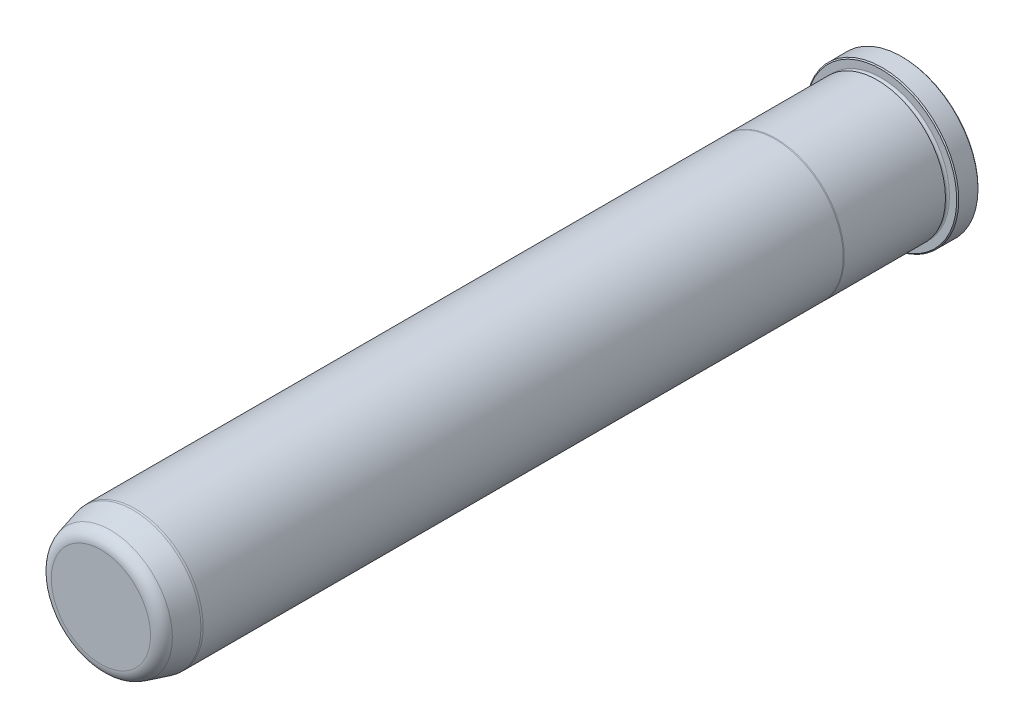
ISO-10303-21;
HEADER;
FILE_DESCRIPTION(('STEP AP214'),'2;1');
FILE_NAME('part.step','',(''),(''),'','','');
FILE_SCHEMA(('AUTOMOTIVE_DESIGN { 1 0 10303 214 1 1 1 1 }'));
ENDSEC;
DATA;
#1=APPLICATION_CONTEXT('core data for automotive mechanical design processes');
#2=APPLICATION_PROTOCOL_DEFINITION('international standard','automotive_design',2000,#1);
#3=PRODUCT_CONTEXT('',#1,'mechanical');
#4=PRODUCT('Part','Part','',(#3));
#5=PRODUCT_RELATED_PRODUCT_CATEGORY('part','',(#4));
#6=PRODUCT_DEFINITION_FORMATION('','',#4);
#7=PRODUCT_DEFINITION_CONTEXT('part definition',#1,'design');
#8=PRODUCT_DEFINITION('design','',#6,#7);
#9=PRODUCT_DEFINITION_SHAPE('','',#8);
#10=(LENGTH_UNIT() NAMED_UNIT(*) SI_UNIT(.MILLI.,.METRE.));
#11=(NAMED_UNIT(*) PLANE_ANGLE_UNIT() SI_UNIT($,.RADIAN.));
#12=(NAMED_UNIT(*) SI_UNIT($,.STERADIAN.) SOLID_ANGLE_UNIT());
#13=UNCERTAINTY_MEASURE_WITH_UNIT(LENGTH_MEASURE(1.E-05),#10,'distance_accuracy_value','');
#14=(GEOMETRIC_REPRESENTATION_CONTEXT(3) GLOBAL_UNCERTAINTY_ASSIGNED_CONTEXT((#13)) GLOBAL_UNIT_ASSIGNED_CONTEXT((#10,
#11,#12)) REPRESENTATION_CONTEXT('',''));
#15=CARTESIAN_POINT('',(0.,0.,0.));
#16=DIRECTION('',(0.,0.,1.));
#17=DIRECTION('',(1.,0.,0.));
#18=AXIS2_PLACEMENT_3D('',#15,#16,#17);
#19=CARTESIAN_POINT('',(0.,0.,0.));
#20=DIRECTION('',(0.,0.,1.));
#21=DIRECTION('',(1.,0.,0.));
#22=AXIS2_PLACEMENT_3D('',#19,#20,#21);
#23=PLANE('',#22);
#24=CARTESIAN_POINT('',(0.,0.,0.));
#25=DIRECTION('',(0.,0.,1.));
#26=DIRECTION('',(1.,0.,0.));
#27=AXIS2_PLACEMENT_3D('',#24,#25,#26);
#28=CIRCLE('',#27,28.067);
#29=CARTESIAN_POINT('',(28.067,0.,0.));
#30=VERTEX_POINT('',#29);
#31=EDGE_CURVE('E37',#30,#30,#28,.F.);
#32=ORIENTED_EDGE('',*,*,#31,.T.);
#33=EDGE_LOOP('',(#32));
#34=FACE_BOUND('',#33,.T.);
#35=ADVANCED_FACE('F30',(#34),#23,.F.);
#36=CARTESIAN_POINT('',(0.,0.,0.));
#37=DIRECTION('',(0.,0.,1.));
#38=DIRECTION('',(1.,0.,0.));
#39=AXIS2_PLACEMENT_3D('',#36,#37,#38);
#40=CYLINDRICAL_SURFACE('',#39,28.448);
#41=CARTESIAN_POINT('',(0.,0.,0.381000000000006));
#42=DIRECTION('',(0.,0.,1.));
#43=DIRECTION('',(1.,0.,0.));
#44=AXIS2_PLACEMENT_3D('',#41,#42,#43);
#45=CIRCLE('',#44,28.448);
#46=CARTESIAN_POINT('',(28.448,0.,0.381000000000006));
#47=VERTEX_POINT('',#46);
#48=EDGE_CURVE('E41',#47,#47,#45,.T.);
#49=CARTESIAN_POINT('',(0.,0.,7.54379999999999));
#50=DIRECTION('',(0.,0.,-1.));
#51=DIRECTION('',(-1.,0.,0.));
#52=AXIS2_PLACEMENT_3D('',#49,#50,#51);
#53=CIRCLE('',#52,28.448);
#54=CARTESIAN_POINT('',(28.448,0.,7.54379999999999));
#55=VERTEX_POINT('',#54);
#56=EDGE_CURVE('E45',#55,#55,#53,.T.);
#57=CARTESIAN_POINT('',(28.448,0.,0.381000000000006));
#58=CARTESIAN_POINT('',(28.448,0.,0.455612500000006));
#59=CARTESIAN_POINT('',(28.448,0.,0.530225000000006));
#60=CARTESIAN_POINT('',(28.448,0.,0.679450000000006));
#61=CARTESIAN_POINT('',(28.448,0.,0.754062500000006));
#62=CARTESIAN_POINT('',(28.448,0.,0.903287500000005));
#63=CARTESIAN_POINT('',(28.448,0.,0.977900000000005));
#64=CARTESIAN_POINT('',(28.448,0.,1.12712500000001));
#65=CARTESIAN_POINT('',(28.448,0.,1.2017375));
#66=CARTESIAN_POINT('',(28.448,0.,1.3509625));
#67=CARTESIAN_POINT('',(28.448,0.,1.425575));
#68=CARTESIAN_POINT('',(28.448,0.,1.5748));
#69=CARTESIAN_POINT('',(28.448,0.,1.6494125));
#70=CARTESIAN_POINT('',(28.448,0.,1.7986375));
#71=CARTESIAN_POINT('',(28.448,0.,1.87325));
#72=CARTESIAN_POINT('',(28.448,0.,2.022475));
#73=CARTESIAN_POINT('',(28.448,0.,2.0970875));
#74=CARTESIAN_POINT('',(28.448,0.,2.2463125));
#75=CARTESIAN_POINT('',(28.448,0.,2.320925));
#76=CARTESIAN_POINT('',(28.448,0.,2.47015));
#77=CARTESIAN_POINT('',(28.448,0.,2.5447625));
#78=CARTESIAN_POINT('',(28.448,0.,2.6939875));
#79=CARTESIAN_POINT('',(28.448,0.,2.7686));
#80=CARTESIAN_POINT('',(28.448,0.,2.917825));
#81=CARTESIAN_POINT('',(28.448,0.,2.9924375));
#82=CARTESIAN_POINT('',(28.448,0.,3.1416625));
#83=CARTESIAN_POINT('',(28.448,0.,3.216275));
#84=CARTESIAN_POINT('',(28.448,0.,3.3655));
#85=CARTESIAN_POINT('',(28.448,0.,3.4401125));
#86=CARTESIAN_POINT('',(28.448,0.,3.5893375));
#87=CARTESIAN_POINT('',(28.448,0.,3.66395));
#88=CARTESIAN_POINT('',(28.448,0.,3.813175));
#89=CARTESIAN_POINT('',(28.448,0.,3.8877875));
#90=CARTESIAN_POINT('',(28.448,0.,4.0370125));
#91=CARTESIAN_POINT('',(28.448,0.,4.111625));
#92=CARTESIAN_POINT('',(28.448,0.,4.26085));
#93=CARTESIAN_POINT('',(28.448,0.,4.3354625));
#94=CARTESIAN_POINT('',(28.448,0.,4.4846875));
#95=CARTESIAN_POINT('',(28.448,0.,4.5593));
#96=CARTESIAN_POINT('',(28.448,0.,4.708525));
#97=CARTESIAN_POINT('',(28.448,0.,4.7831375));
#98=CARTESIAN_POINT('',(28.448,0.,4.9323625));
#99=CARTESIAN_POINT('',(28.448,0.,5.006975));
#100=CARTESIAN_POINT('',(28.448,0.,5.1562));
#101=CARTESIAN_POINT('',(28.448,0.,5.2308125));
#102=CARTESIAN_POINT('',(28.448,0.,5.3800375));
#103=CARTESIAN_POINT('',(28.448,0.,5.45465));
#104=CARTESIAN_POINT('',(28.448,0.,5.603875));
#105=CARTESIAN_POINT('',(28.448,0.,5.6784875));
#106=CARTESIAN_POINT('',(28.448,0.,5.8277125));
#107=CARTESIAN_POINT('',(28.448,0.,5.902325));
#108=CARTESIAN_POINT('',(28.448,0.,6.05155));
#109=CARTESIAN_POINT('',(28.448,0.,6.1261625));
#110=CARTESIAN_POINT('',(28.448,0.,6.27538749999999));
#111=CARTESIAN_POINT('',(28.448,0.,6.35));
#112=CARTESIAN_POINT('',(28.448,0.,6.49922499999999));
#113=CARTESIAN_POINT('',(28.448,0.,6.5738375));
#114=CARTESIAN_POINT('',(28.448,0.,6.72306249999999));
#115=CARTESIAN_POINT('',(28.448,0.,6.79767499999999));
#116=CARTESIAN_POINT('',(28.448,0.,6.94689999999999));
#117=CARTESIAN_POINT('',(28.448,0.,7.02151249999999));
#118=CARTESIAN_POINT('',(28.448,0.,7.17073749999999));
#119=CARTESIAN_POINT('',(28.448,0.,7.24534999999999));
#120=CARTESIAN_POINT('',(28.448,0.,7.39457499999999));
#121=CARTESIAN_POINT('',(28.448,0.,7.46918749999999));
#122=CARTESIAN_POINT('',(28.448,0.,7.54379999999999));
#123=B_SPLINE_CURVE_WITH_KNOTS('',3,(#57,#58,#59,#60,#61,#62,#63,#64,#65,#66,#67,#68,#69,#70,
#71,#72,#73,#74,#75,#76,#77,#78,#79,#80,#81,#82,#83,#84,#85,#86,#87,#88,#89,#90,#91,#92,#93,#94,
#95,#96,#97,#98,#99,#100,#101,#102,#103,#104,#105,#106,#107,#108,#109,#110,#111,#112,#113,#114,
#115,#116,#117,#118,#119,#120,#121,#122),.UNSPECIFIED.,.F.,.F.,(4,2,2,2,2,2,2,2,2,2,2,2,2,2,2,2,
2,2,2,2,2,2,2,2,2,2,2,2,2,2,2,2,4),(0.,0.2238375,0.447674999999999,0.671512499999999,
0.895349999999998,1.1191875,1.343025,1.5668625,1.7907,2.0145375,2.238375,2.4622125,
2.68604999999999,2.90988749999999,3.13372499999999,3.35756249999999,3.58139999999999,
3.80523749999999,4.02907499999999,4.25291249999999,4.47674999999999,4.70058749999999,
4.92442499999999,5.14826249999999,5.37209999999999,5.59593749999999,5.81977499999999,
6.04361249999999,6.26744999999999,6.49128749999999,6.71512499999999,6.93896249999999,
7.16279999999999),.UNSPECIFIED.);
#124=EDGE_CURVE('BSEAM118',#47,#55,#123,.T.);
#125=ORIENTED_EDGE('',*,*,#48,.T.);
#126=ORIENTED_EDGE('',*,*,#56,.T.);
#127=ORIENTED_EDGE('',*,*,#124,.T.);
#128=ORIENTED_EDGE('',*,*,#124,.F.);
#129=EDGE_LOOP('',(#125,#127,#126,#128));
#130=FACE_BOUND('',#129,.T.);
#131=ADVANCED_FACE('F118',(#130),#40,.T.);
#132=CARTESIAN_POINT('',(0.,28.448,7.9248));
#133=DIRECTION('',(0.,0.,-1.));
#134=DIRECTION('',(-1.,0.,0.));
#135=AXIS2_PLACEMENT_3D('',#132,#133,#134);
#136=PLANE('',#135);
#137=CARTESIAN_POINT('',(0.,0.,7.9248));
#138=DIRECTION('',(0.,0.,-1.));
#139=DIRECTION('',(-1.,0.,0.));
#140=AXIS2_PLACEMENT_3D('',#137,#138,#139);
#141=CIRCLE('',#140,28.067);
#142=CARTESIAN_POINT('',(-28.067,0.,7.9248));
#143=VERTEX_POINT('',#142);
#144=EDGE_CURVE('E10',#143,#143,#141,.F.);
#145=ORIENTED_EDGE('',*,*,#144,.T.);
#146=EDGE_LOOP('',(#145));
#147=FACE_BOUND('',#146,.T.);
#148=CARTESIAN_POINT('',(0.,0.,7.9248));
#149=DIRECTION('',(0.,0.,1.));
#150=DIRECTION('',(1.,0.,0.));
#151=AXIS2_PLACEMENT_3D('',#148,#149,#150);
#152=CIRCLE('',#151,25.3873);
#153=CARTESIAN_POINT('',(25.3873,0.,7.9248));
#154=VERTEX_POINT('',#153);
#155=EDGE_CURVE('E56',#154,#154,#152,.T.);
#156=ORIENTED_EDGE('',*,*,#155,.F.);
#157=EDGE_LOOP('',(#156));
#158=FACE_BOUND('',#157,.T.);
#159=ADVANCED_FACE('F113',(#147,#158),#136,.F.);
#160=CARTESIAN_POINT('',(0.,0.,8.6868));
#161=DIRECTION('',(0.,0.,1.));
#162=DIRECTION('',(1.,0.,0.));
#163=AXIS2_PLACEMENT_3D('',#160,#161,#162);
#164=TOROIDAL_SURFACE('',#163,25.3873,0.761999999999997);
#165=CARTESIAN_POINT('',(0.,0.,9.44879999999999));
#166=DIRECTION('',(0.,0.,1.));
#167=DIRECTION('',(1.,0.,0.));
#168=AXIS2_PLACEMENT_3D('',#165,#166,#167);
#169=CIRCLE('',#168,25.3873);
#170=CARTESIAN_POINT('',(25.3873,0.,9.44879999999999));
#171=VERTEX_POINT('',#170);
#172=EDGE_CURVE('E59',#171,#171,#169,.T.);
#173=ORIENTED_EDGE('',*,*,#172,.F.);
#174=EDGE_LOOP('',(#173));
#175=FACE_BOUND('',#174,.T.);
#176=ORIENTED_EDGE('',*,*,#155,.T.);
#177=EDGE_LOOP('',(#176));
#178=FACE_BOUND('',#177,.T.);
#179=ADVANCED_FACE('F107',(#175,#178),#164,.F.);
#180=CARTESIAN_POINT('',(0.,25.3873,9.44879999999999));
#181=DIRECTION('',(0.,0.,1.));
#182=DIRECTION('',(1.,0.,0.));
#183=AXIS2_PLACEMENT_3D('',#180,#181,#182);
#184=PLANE('',#183);
#185=CARTESIAN_POINT('',(0.,0.,9.4488));
#186=DIRECTION('',(0.,0.,1.));
#187=DIRECTION('',(1.,0.,0.));
#188=AXIS2_PLACEMENT_3D('',#185,#186,#187);
#189=CIRCLE('',#188,25.4127);
#190=CARTESIAN_POINT('',(25.4127,0.,9.4488));
#191=VERTEX_POINT('',#190);
#192=EDGE_CURVE('E62',#191,#191,#189,.T.);
#193=ORIENTED_EDGE('',*,*,#192,.F.);
#194=EDGE_LOOP('',(#193));
#195=FACE_BOUND('',#194,.T.);
#196=ORIENTED_EDGE('',*,*,#172,.T.);
#197=EDGE_LOOP('',(#196));
#198=FACE_BOUND('',#197,.T.);
#199=ADVANCED_FACE('F101',(#195,#198),#184,.F.);
#200=CARTESIAN_POINT('',(0.,0.,0.));
#201=DIRECTION('',(0.,0.,1.));
#202=DIRECTION('',(1.,0.,0.));
#203=AXIS2_PLACEMENT_3D('',#200,#201,#202);
#204=CYLINDRICAL_SURFACE('',#203,25.4127);
#205=CARTESIAN_POINT('',(0.,0.,47.1347630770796));
#206=DIRECTION('',(0.,0.,1.));
#207=DIRECTION('',(1.,0.,0.));
#208=AXIS2_PLACEMENT_3D('',#205,#206,#207);
#209=CIRCLE('',#208,25.4127);
#210=CARTESIAN_POINT('',(25.4127,0.,47.1347630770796));
#211=VERTEX_POINT('',#210);
#212=EDGE_CURVE('E65',#211,#211,#209,.T.);
#213=ORIENTED_EDGE('',*,*,#212,.F.);
#214=EDGE_LOOP('',(#213));
#215=FACE_BOUND('',#214,.T.);
#216=ORIENTED_EDGE('',*,*,#192,.T.);
#217=EDGE_LOOP('',(#216));
#218=FACE_BOUND('',#217,.T.);
#219=ADVANCED_FACE('F95',(#215,#218),#204,.T.);
#220=CARTESIAN_POINT('',(0.,0.,47.1347630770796));
#221=DIRECTION('',(0.,0.,-1.));
#222=DIRECTION('',(-1.,0.,0.));
#223=AXIS2_PLACEMENT_3D('',#220,#221,#222);
#224=CONICAL_SURFACE('',#223,25.4127,0.0698131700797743);
#225=CARTESIAN_POINT('',(0.,0.,47.498));
#226=DIRECTION('',(0.,0.,1.));
#227=DIRECTION('',(1.,0.,0.));
#228=AXIS2_PLACEMENT_3D('',#225,#226,#227);
#229=CIRCLE('',#228,25.3873);
#230=CARTESIAN_POINT('',(25.3873,0.,47.498));
#231=VERTEX_POINT('',#230);
#232=EDGE_CURVE('E68',#231,#231,#229,.T.);
#233=ORIENTED_EDGE('',*,*,#232,.F.);
#234=EDGE_LOOP('',(#233));
#235=FACE_BOUND('',#234,.T.);
#236=ORIENTED_EDGE('',*,*,#212,.T.);
#237=EDGE_LOOP('',(#236));
#238=FACE_BOUND('',#237,.T.);
#239=ADVANCED_FACE('F89',(#235,#238),#224,.T.);
#240=CARTESIAN_POINT('',(0.,0.,0.));
#241=DIRECTION('',(0.,0.,1.));
#242=DIRECTION('',(1.,0.,0.));
#243=AXIS2_PLACEMENT_3D('',#240,#241,#242);
#244=CYLINDRICAL_SURFACE('',#243,25.3873);
#245=CARTESIAN_POINT('',(0.,0.,285.75));
#246=DIRECTION('',(0.,0.,1.));
#247=DIRECTION('',(1.,0.,0.));
#248=AXIS2_PLACEMENT_3D('',#245,#246,#247);
#249=CIRCLE('',#248,25.3873);
#250=CARTESIAN_POINT('',(25.3873,0.,285.75));
#251=VERTEX_POINT('',#250);
#252=EDGE_CURVE('E71',#251,#251,#249,.T.);
#253=ORIENTED_EDGE('',*,*,#252,.F.);
#254=EDGE_LOOP('',(#253));
#255=FACE_BOUND('',#254,.T.);
#256=ORIENTED_EDGE('',*,*,#232,.T.);
#257=EDGE_LOOP('',(#256));
#258=FACE_BOUND('',#257,.T.);
#259=ADVANCED_FACE('F83',(#255,#258),#244,.T.);
#260=CARTESIAN_POINT('',(0.,0.,285.75));
#261=DIRECTION('',(0.,0.,-1.));
#262=DIRECTION('',(-1.,0.,0.));
#263=AXIS2_PLACEMENT_3D('',#260,#261,#262);
#264=CONICAL_SURFACE('',#263,25.3873,0.0872664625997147);
#265=CARTESIAN_POINT('',(0.,0.,286.512));
#266=DIRECTION('',(0.,0.,1.));
#267=DIRECTION('',(1.,0.,0.));
#268=AXIS2_PLACEMENT_3D('',#265,#266,#267);
#269=CIRCLE('',#268,25.3206336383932);
#270=CARTESIAN_POINT('',(25.3206336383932,0.,286.512));
#271=VERTEX_POINT('',#270);
#272=EDGE_CURVE('E74',#271,#271,#269,.T.);
#273=ORIENTED_EDGE('',*,*,#272,.F.);
#274=EDGE_LOOP('',(#273));
#275=FACE_BOUND('',#274,.T.);
#276=ORIENTED_EDGE('',*,*,#252,.T.);
#277=EDGE_LOOP('',(#276));
#278=FACE_BOUND('',#277,.T.);
#279=ADVANCED_FACE('F80',(#275,#278),#264,.T.);
#280=CARTESIAN_POINT('',(0.,0.,286.512));
#281=DIRECTION('',(0.,0.,-1.));
#282=DIRECTION('',(-1.,0.,0.));
#283=AXIS2_PLACEMENT_3D('',#280,#281,#282);
#284=CONICAL_SURFACE('',#283,25.3206336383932,0.26179938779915);
#285=CARTESIAN_POINT('',(0.,0.,294.920125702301));
#286=DIRECTION('',(0.,0.,1.));
#287=DIRECTION('',(1.,0.,0.));
#288=AXIS2_PLACEMENT_3D('',#285,#286,#287);
#289=CIRCLE('',#288,23.0676831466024);
#290=CARTESIAN_POINT('',(23.0676831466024,0.,294.920125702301));
#291=VERTEX_POINT('',#290);
#292=EDGE_CURVE('E50',#291,#291,#289,.F.);
#293=ORIENTED_EDGE('',*,*,#292,.T.);
#294=EDGE_LOOP('',(#293));
#295=FACE_BOUND('',#294,.T.);
#296=ORIENTED_EDGE('',*,*,#272,.T.);
#297=EDGE_LOOP('',(#296));
#298=FACE_BOUND('',#297,.T.);
#299=ADVANCED_FACE('F78',(#295,#298),#284,.T.);
#300=CARTESIAN_POINT('',(0.,22.1218561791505,298.45));
#301=DIRECTION('',(0.,0.,-1.));
#302=DIRECTION('',(-1.,0.,0.));
#303=AXIS2_PLACEMENT_3D('',#300,#301,#302);
#304=PLANE('',#303);
#305=CARTESIAN_POINT('',(0.,0.,298.45));
#306=DIRECTION('',(0.,0.,-1.));
#307=DIRECTION('',(-1.,0.,0.));
#308=AXIS2_PLACEMENT_3D('',#305,#306,#307);
#309=CIRCLE('',#308,18.4674613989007);
#310=CARTESIAN_POINT('',(-18.4674613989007,0.,298.45));
#311=VERTEX_POINT('',#310);
#312=EDGE_CURVE('E53',#311,#311,#309,.F.);
#313=ORIENTED_EDGE('',*,*,#312,.T.);
#314=EDGE_LOOP('',(#313));
#315=FACE_BOUND('',#314,.T.);
#316=ADVANCED_FACE('F133',(#315),#304,.F.);
#317=CARTESIAN_POINT('',(0.,0.,293.6875));
#318=DIRECTION('',(0.,0.,-1.));
#319=DIRECTION('',(-1.,0.,0.));
#320=AXIS2_PLACEMENT_3D('',#317,#318,#319);
#321=TOROIDAL_SURFACE('',#320,18.4674613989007,4.7625);
#322=ORIENTED_EDGE('',*,*,#292,.F.);
#323=EDGE_LOOP('',(#322));
#324=FACE_BOUND('',#323,.T.);
#325=ORIENTED_EDGE('',*,*,#312,.F.);
#326=EDGE_LOOP('',(#325));
#327=FACE_BOUND('',#326,.T.);
#328=ADVANCED_FACE('F130',(#324,#327),#321,.T.);
#329=CARTESIAN_POINT('',(0.,0.,0.381000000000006));
#330=DIRECTION('',(0.,0.,1.));
#331=DIRECTION('',(1.,0.,0.));
#332=AXIS2_PLACEMENT_3D('',#329,#330,#331);
#333=CONICAL_SURFACE('',#332,28.448,0.785398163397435);
#334=CARTESIAN_POINT('',(28.067,0.,0.));
#335=CARTESIAN_POINT('',(28.07096875,0.,0.00396875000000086));
#336=CARTESIAN_POINT('',(28.0749375,0.,0.00793750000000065));
#337=CARTESIAN_POINT('',(28.082875,0.,0.0158750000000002));
#338=CARTESIAN_POINT('',(28.08684375,0.,0.01984375));
#339=CARTESIAN_POINT('',(28.09478125,0.,0.0277812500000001));
#340=CARTESIAN_POINT('',(28.09875,0.,0.0317500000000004));
#341=CARTESIAN_POINT('',(28.1066875,0.,0.0396875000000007));
#342=CARTESIAN_POINT('',(28.11065625,0.,0.0436562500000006));
#343=CARTESIAN_POINT('',(28.11859375,0.,0.0515937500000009));
#344=CARTESIAN_POINT('',(28.1225625,0.,0.0555625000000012));
#345=CARTESIAN_POINT('',(28.1305,0.,0.0635000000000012));
#346=CARTESIAN_POINT('',(28.13446875,0.,0.0674687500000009));
#347=CARTESIAN_POINT('',(28.14240625,0.,0.0754062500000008));
#348=CARTESIAN_POINT('',(28.146375,0.,0.0793750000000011));
#349=CARTESIAN_POINT('',(28.1543125,0.,0.0873125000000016));
#350=CARTESIAN_POINT('',(28.15828125,0.,0.0912812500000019));
#351=CARTESIAN_POINT('',(28.16621875,0.,0.0992187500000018));
#352=CARTESIAN_POINT('',(28.1701875,0.,0.103187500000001));
#353=CARTESIAN_POINT('',(28.178125,0.,0.111125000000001));
#354=CARTESIAN_POINT('',(28.18209375,0.,0.115093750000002));
#355=CARTESIAN_POINT('',(28.19003125,0.,0.123031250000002));
#356=CARTESIAN_POINT('',(28.194,0.,0.127000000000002));
#357=CARTESIAN_POINT('',(28.2019375,0.,0.134937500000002));
#358=CARTESIAN_POINT('',(28.20590625,0.,0.138906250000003));
#359=CARTESIAN_POINT('',(28.21384375,0.,0.146843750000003));
#360=CARTESIAN_POINT('',(28.2178125,0.,0.150812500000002));
#361=CARTESIAN_POINT('',(28.22575,0.,0.158750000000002));
#362=CARTESIAN_POINT('',(28.22971875,0.,0.162718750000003));
#363=CARTESIAN_POINT('',(28.23765625,0.,0.170656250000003));
#364=CARTESIAN_POINT('',(28.241625,0.,0.174625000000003));
#365=CARTESIAN_POINT('',(28.2495625,0.,0.182562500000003));
#366=CARTESIAN_POINT('',(28.25353125,0.,0.186531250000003));
#367=CARTESIAN_POINT('',(28.26146875,0.,0.194468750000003));
#368=CARTESIAN_POINT('',(28.2654375,0.,0.198437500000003));
#369=CARTESIAN_POINT('',(28.273375,0.,0.206375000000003));
#370=CARTESIAN_POINT('',(28.27734375,0.,0.210343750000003));
#371=CARTESIAN_POINT('',(28.28528125,0.,0.218281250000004));
#372=CARTESIAN_POINT('',(28.28925,0.,0.222250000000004));
#373=CARTESIAN_POINT('',(28.2971875,0.,0.230187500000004));
#374=CARTESIAN_POINT('',(28.30115625,0.,0.234156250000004));
#375=CARTESIAN_POINT('',(28.30909375,0.,0.242093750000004));
#376=CARTESIAN_POINT('',(28.3130625,0.,0.246062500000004));
#377=CARTESIAN_POINT('',(28.321,0.,0.254000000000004));
#378=CARTESIAN_POINT('',(28.32496875,0.,0.257968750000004));
#379=CARTESIAN_POINT('',(28.33290625,0.,0.265906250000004));
#380=CARTESIAN_POINT('',(28.336875,0.,0.269875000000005));
#381=CARTESIAN_POINT('',(28.3448125,0.,0.277812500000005));
#382=CARTESIAN_POINT('',(28.34878125,0.,0.281781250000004));
#383=CARTESIAN_POINT('',(28.35671875,0.,0.289718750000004));
#384=CARTESIAN_POINT('',(28.3606875,0.,0.293687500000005));
#385=CARTESIAN_POINT('',(28.368625,0.,0.301625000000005));
#386=CARTESIAN_POINT('',(28.37259375,0.,0.305593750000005));
#387=CARTESIAN_POINT('',(28.38053125,0.,0.313531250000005));
#388=CARTESIAN_POINT('',(28.3845,0.,0.317500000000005));
#389=CARTESIAN_POINT('',(28.3924375,0.,0.325437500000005));
#390=CARTESIAN_POINT('',(28.39640625,0.,0.329406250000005));
#391=CARTESIAN_POINT('',(28.40434375,0.,0.337343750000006));
#392=CARTESIAN_POINT('',(28.4083125,0.,0.341312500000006));
#393=CARTESIAN_POINT('',(28.41625,0.,0.349250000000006));
#394=CARTESIAN_POINT('',(28.42021875,0.,0.353218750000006));
#395=CARTESIAN_POINT('',(28.42815625,0.,0.361156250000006));
#396=CARTESIAN_POINT('',(28.432125,0.,0.365125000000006));
#397=CARTESIAN_POINT('',(28.4400625,0.,0.373062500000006));
#398=CARTESIAN_POINT('',(28.44403125,0.,0.377031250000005));
#399=CARTESIAN_POINT('',(28.448,0.,0.381000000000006));
#400=B_SPLINE_CURVE_WITH_KNOTS('',3,(#334,#335,#336,#337,#338,#339,#340,#341,#342,#343,#344,
#345,#346,#347,#348,#349,#350,#351,#352,#353,#354,#355,#356,#357,#358,#359,#360,#361,#362,#363,
#364,#365,#366,#367,#368,#369,#370,#371,#372,#373,#374,#375,#376,#377,#378,#379,#380,#381,#382,
#383,#384,#385,#386,#387,#388,#389,#390,#391,#392,#393,#394,#395,#396,#397,#398,#399),
.UNSPECIFIED.,.F.,.F.,(4,2,2,2,2,2,2,2,2,2,2,2,2,2,2,2,2,2,2,2,2,2,2,2,2,2,2,2,2,2,2,2,4),(0.,
0.016837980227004,0.0336759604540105,0.0505139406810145,0.0673519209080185,0.0841899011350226,
0.101027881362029,0.117865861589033,0.134703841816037,0.151541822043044,0.168379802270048,
0.185217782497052,0.202055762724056,0.218893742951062,0.235731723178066,0.25256970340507,
0.269407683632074,0.286245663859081,0.303083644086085,0.319921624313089,0.336759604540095,
0.353597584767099,0.370435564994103,0.387273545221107,0.404111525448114,0.420949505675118,
0.437787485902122,0.454625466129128,0.471463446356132,0.488301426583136,0.50513940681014,
0.521977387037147,0.538815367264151),.UNSPECIFIED.);
#401=EDGE_CURVE('BSEAM132',#30,#47,#400,.T.);
#402=ORIENTED_EDGE('',*,*,#31,.F.);
#403=ORIENTED_EDGE('',*,*,#48,.F.);
#404=ORIENTED_EDGE('',*,*,#401,.T.);
#405=ORIENTED_EDGE('',*,*,#401,.F.);
#406=EDGE_LOOP('',(#402,#404,#403,#405));
#407=FACE_BOUND('',#406,.T.);
#408=ADVANCED_FACE('F132',(#407),#333,.T.);
#409=CARTESIAN_POINT('',(0.,0.,7.9248));
#410=DIRECTION('',(0.,0.,-1.));
#411=DIRECTION('',(-1.,0.,0.));
#412=AXIS2_PLACEMENT_3D('',#409,#410,#411);
#413=CONICAL_SURFACE('',#412,28.067,0.785398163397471);
#414=ORIENTED_EDGE('',*,*,#56,.F.);
#415=EDGE_LOOP('',(#414));
#416=FACE_BOUND('',#415,.T.);
#417=ORIENTED_EDGE('',*,*,#144,.F.);
#418=EDGE_LOOP('',(#417));
#419=FACE_BOUND('',#418,.T.);
#420=ADVANCED_FACE('F32',(#416,#419),#413,.T.);
#421=CLOSED_SHELL('',(#35,#131,#159,#179,#199,#219,#239,#259,#279,#299,#316,#328,#408,#420));
#422=MANIFOLD_SOLID_BREP('B2',#421);
#423=ADVANCED_BREP_SHAPE_REPRESENTATION('',(#18,#422),#14);
#424=SHAPE_DEFINITION_REPRESENTATION(#9,#423);
ENDSEC;
END-ISO-10303-21;
